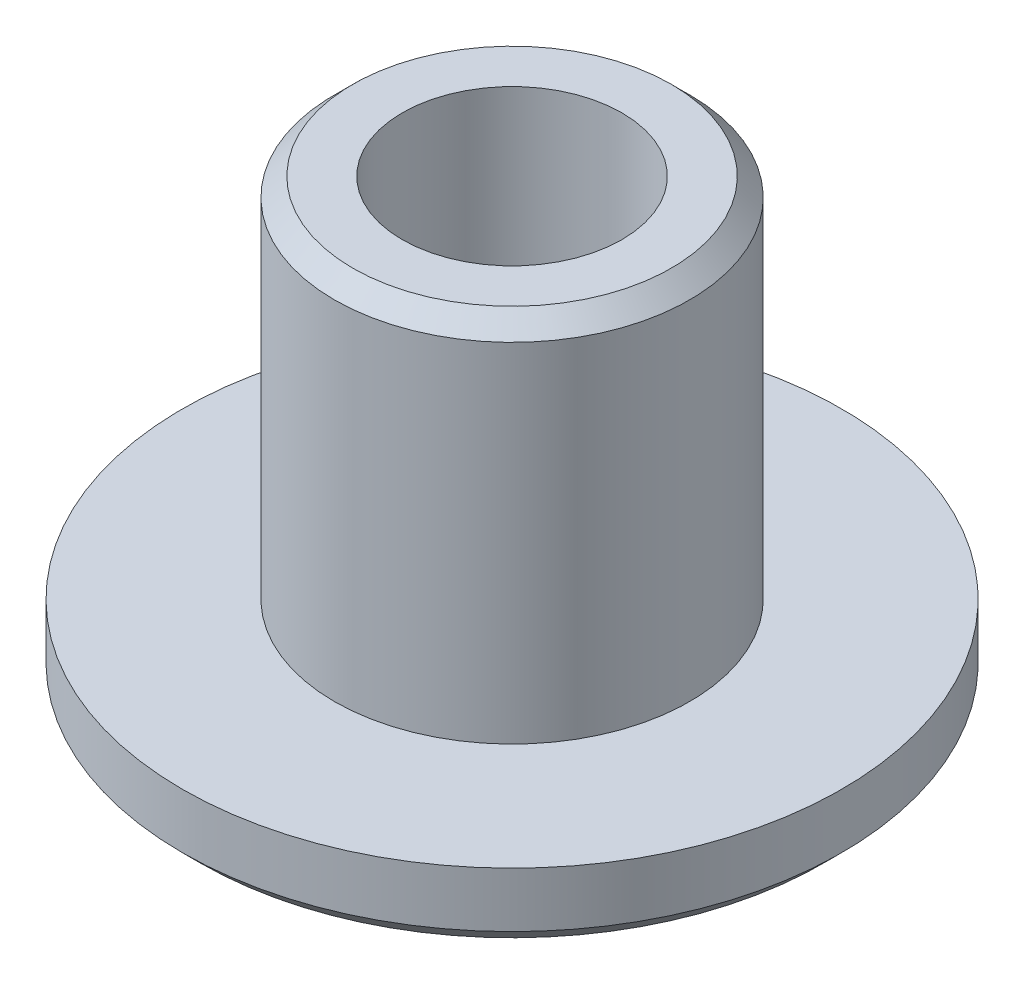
from build123d import *

# Parameters (mm, degrees)
SKIZZE1_R                       = 9
SKIZZE1_R_2                     = 3
AUFSATZ_LINEAR_AUSTRAGEN1_DEPTH = 2
SKIZZE2_R                       = 4.85
SKIZZE2_R_2                     = 3
AUFSATZ_LINEAR_AUSTRAGEN2_DEPTH = 10
FASE1_SIZE                      = 0.5


with BuildPart() as part:
    # Skizze1 → Aufsatz-Linear austragen1 (new body)
    with BuildSketch(Plane(origin=(0, 0, 0), x_dir=(1, 0, 0), z_dir=(0, 1, 0))):
        with Locations(Location((0, 0, 0), (0, 0, 270))):
            Circle(SKIZZE1_R)
        with Locations(Location((0, 0, 0), (0, 0, 270))):
            Circle(SKIZZE1_R_2, mode=Mode.SUBTRACT)
    extrude(amount=AUFSATZ_LINEAR_AUSTRAGEN1_DEPTH)

    # Skizze2 → Aufsatz-Linear austragen2 (add)
    with BuildSketch(Plane(origin=(0, 2, 0), x_dir=(1, 0, 0), z_dir=(0, 1, 0))):
        with Locations(Location((0, 0, 0), (0, 0, 270))):
            Circle(SKIZZE2_R)
        with Locations(Location((0, 0, 0), (0, 0, 270))):
            Circle(SKIZZE2_R_2, mode=Mode.SUBTRACT)
    extrude(amount=AUFSATZ_LINEAR_AUSTRAGEN2_DEPTH)

    # Fase1
    fase1_edges = [part.edges().sort_by_distance(p)[0] for p in [
        (0, 12, -4.85),
        (0, 0, -9),
    ]]
    chamfer(fase1_edges, length=FASE1_SIZE)


solid = part.part
